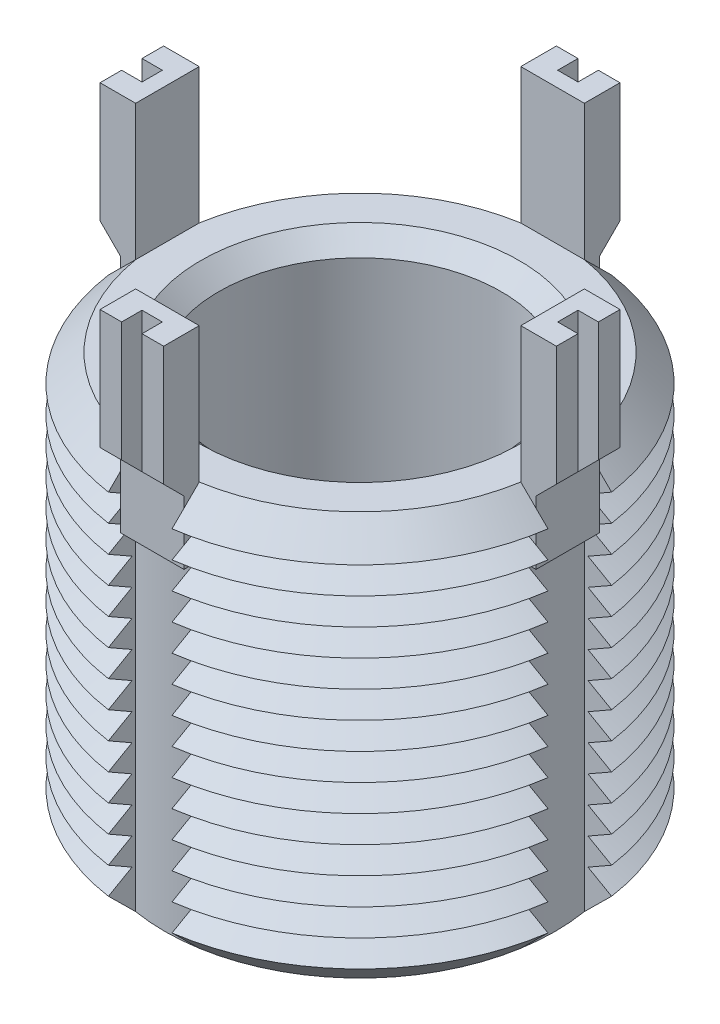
from build123d import *

# Parameters (mm, degrees)
SKETCH1_R               = 17.4625
BOSS_EXTRUDE1_DEPTH     = 31.75
CHAMFER1_SIZE           = 2.117
LPATTERN1_COUNT         = 13
LPATTERN1_PITCH         = 2.117
CUT_EXTRUDE1_REACH      = 42.224
CIRPATTERN1_COUNT       = 4
BOSS_EXTRUDE3_DEPTH     = 2.5
CIRPATTERN2_COUNT       = 4
CUT_EXTRUDE3_DEPTH      = 50.410499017
CUT_EXTRUDE3_DEPTH_BACK = 50.410499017
SKETCH6_W               = 1.6
SKETCH6_H               = 1.6
SKETCH7_R               = 11.1125
CUT_EXTRUDE4_DEPTH      = 31.75
CHAMFER2_SIZE           = 1.411


with BuildPart() as part:
    # Sketch1 → Boss-Extrude1 (new body)
    with BuildSketch(Plane(origin=(0, 0, 0), x_dir=(1, 0, 0), z_dir=(0, 1, 0))):
        with Locations(Location((0, 0, 0), (0, 0, 270))):
            Circle(SKETCH1_R)
    extrude(amount=-BOSS_EXTRUDE1_DEPTH)

    # Chamfer1
    chamfer1_edges = [part.edges().sort_by_distance(p)[0] for p in [
        (0, 0, -17.4625),
        (0, -31.75, -17.4625),
    ]]
    chamfer(chamfer1_edges, length=CHAMFER1_SIZE)

    # Sketch3 → Cut-Revolve1 (revolve, cut)
    with BuildSketch(Plane(origin=(0, 0, 0), x_dir=(0, 0, -1), z_dir=(1, 0, 0))):
        Polygon((-17.4625, -2.117), (-15.62912422, -3.1755), (-17.4625, -4.234), align=None)
    cut_revolve1 = revolve(axis=Axis((0, 0.885892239, 0), (0, -1, 0)), mode=Mode.SUBTRACT)

    # LPattern1: Cut-Revolve1 ×13
    with Locations(*[(0, -i * LPATTERN1_PITCH, 0) for i in range(1, LPATTERN1_COUNT)]):
        add(cut_revolve1, mode=Mode.SUBTRACT)

    # Cut-Extrude1: up to this cone (the profile starts inside it)
    cut_extrude1_end = Plane(origin=(0, 0, 0), z_dir=(0, 1, 0)).offset(-47.095499) * Cone(1e-06, 136.915, 136.914999, align=(Align.CENTER, Align.CENTER, Align.MIN), mode=Mode.PRIVATE)
    # Sketch4 → Cut-Extrude1 (cut, up to the surface)
    with BuildSketch(Plane(origin=(0, 0, 0), x_dir=(1, 0, 0), z_dir=(0, 1, 0)), mode=Mode.PRIVATE) as cut_extrude1_sk1:
        with BuildLine():
            Line((-15.140487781, 2.5), (-17.282618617, 2.5))
            ThreePointArc((-17.282618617, 2.5), (-17.4625, 0), (-17.282618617, -2.5))
            Line((-17.282618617, -2.5), (-15.140487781, -2.5))
            ThreePointArc((-15.140487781, -2.5), (-15.3455, 0), (-15.140487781, 2.5))
        make_face()
    cut_extrude1_tool1 = extrude(cut_extrude1_sk1.sketch, amount=-CUT_EXTRUDE1_REACH, mode=Mode.PRIVATE) & cut_extrude1_end
    cut_extrude1 = cut_extrude1_tool1.solids().sort_by_distance((-16.339803, 0, 0))[0]
    add(cut_extrude1, mode=Mode.SUBTRACT)

    # CirPattern1: Cut-Extrude1 ×4 about axis
    cirpattern1_axis = Axis((0, 0, 0), (0, 1, 0))
    for i in range(1, CIRPATTERN1_COUNT):
        add(cut_extrude1.rotate(cirpattern1_axis, i * 360 / CIRPATTERN1_COUNT), mode=Mode.SUBTRACT)

    # Sketch5 → Boss-Extrude3 (add, symmetric)
    with BuildSketch(Plane(origin=(0, 0, 0), x_dir=(0, 0, -1), z_dir=(1, 0, 0))):
        Polygon((-15.140487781, 10.649), (-15.140487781, -5.351), (-16.340487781, -5.351), (-16.340487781, -0.351), (-17.940487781, 1.249), (-17.940487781, 10.649), align=None)
    boss_extrude3 = extrude(amount=BOSS_EXTRUDE3_DEPTH, both=True)

    # CirPattern2: Boss-Extrude3 ×4 about axis
    cirpattern2_axis = Axis((0, 0, 0), (0, 1, 0))
    for i in range(1, CIRPATTERN2_COUNT):
        add(boss_extrude3.rotate(cirpattern2_axis, i * 360 / CIRPATTERN2_COUNT))

    # Sketch6 → Cut-Extrude3 (cut, two sides: drawn at the far end of the back side and taken through both)
    with BuildSketch(Plane(origin=(0, 10.649, 0), x_dir=(1, 0, 0), z_dir=(0, 1, 0)).offset(-CUT_EXTRUDE3_DEPTH_BACK)):
        with Locations((-17.140487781, 0)):
            Rectangle(SKETCH6_W, SKETCH6_H)
        with Locations((0, 17.140487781)):
            Rectangle(SKETCH6_W, SKETCH6_H)
        with Locations((17.140487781, 0)):
            Rectangle(SKETCH6_W, SKETCH6_H)
        with Locations((0, -17.140487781)):
            Rectangle(SKETCH6_W, SKETCH6_H)
    extrude(amount=CUT_EXTRUDE3_DEPTH + CUT_EXTRUDE3_DEPTH_BACK, mode=Mode.SUBTRACT)

    # Sketch7 → Cut-Extrude4 (cut)
    with BuildSketch(Plane(origin=(0, 0, 0), x_dir=(1, 0, 0), z_dir=(0, 1, 0))):
        with Locations(Location((0, 0, 0), (0, 0, 270))):
            Circle(SKETCH7_R)
    extrude(amount=-CUT_EXTRUDE4_DEPTH, mode=Mode.SUBTRACT)

    # Chamfer2
    chamfer2_edges = [part.edges().sort_by_distance(p)[0] for p in [
        (0, 0, -11.1125),
        (0, -31.75, -11.1125),
    ]]
    chamfer(chamfer2_edges, length=CHAMFER2_SIZE)


solid = part.part
